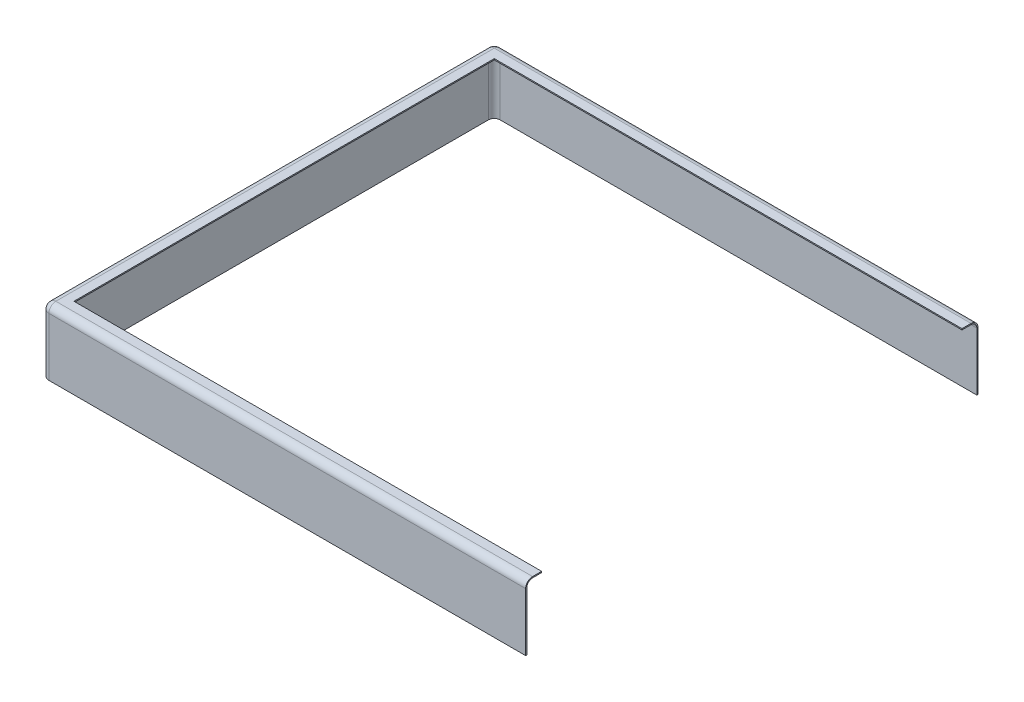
from build123d import *

# Parameters (mm, degrees)
SKETCH_1_W          = 2078
SKETCH_1_H          = 275
EXTRUDE_1_DEPTH     = 1938
SKETCH_2_W          = 2014
SKETCH_2_H          = 1810
CUT_EXTRUDE_1_DEPTH = 2855.742195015
FILLET_1_R          = 25
SHELL_1_T           = 5


with BuildPart() as part:
    # Sketch 1 → Extrude 1 (new body)
    with BuildSketch(Plane.XY):
        with Locations((1039, -137.5)):
            Rectangle(SKETCH_1_W, SKETCH_1_H)
    extrude(amount=EXTRUDE_1_DEPTH)

    # Sketch 2 → Cut-Extrude 1 (cut, through all)
    with BuildSketch(Plane(origin=(0, 0, 0), x_dir=(1, 0, 0), z_dir=(0, 1, 0))):
        with Locations((1071, -969)):
            Rectangle(SKETCH_2_W, SKETCH_2_H)
    extrude(amount=-CUT_EXTRUDE_1_DEPTH, mode=Mode.SUBTRACT)

    # Fillet 1
    fillet_1_edges = [part.edges().sort_by_distance(p)[0] for p in [
        (1039, 0, 1938),
        (0, -137.5, 1938),
        (1039, 0, 0),
        (0, -137.5, 0),
        (0, 0, 969),
    ]]
    fillet(fillet_1_edges, radius=FILLET_1_R)

    # Shell 1
    shell_1_openings = [part.faces().sort_by_distance(p)[0] for p in [
        (2078, -138.51302451, 32.202855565),
        (1071, -137.5, 64),
        (64, -137.5, 969),
        (1071, -137.5, 1874),
        (2078, -138.51302451, 1905.797144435),
        (1051.5, -275, 28.414658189),
    ]]
    offset(amount=SHELL_1_T, openings=shell_1_openings)


solid = part.part
